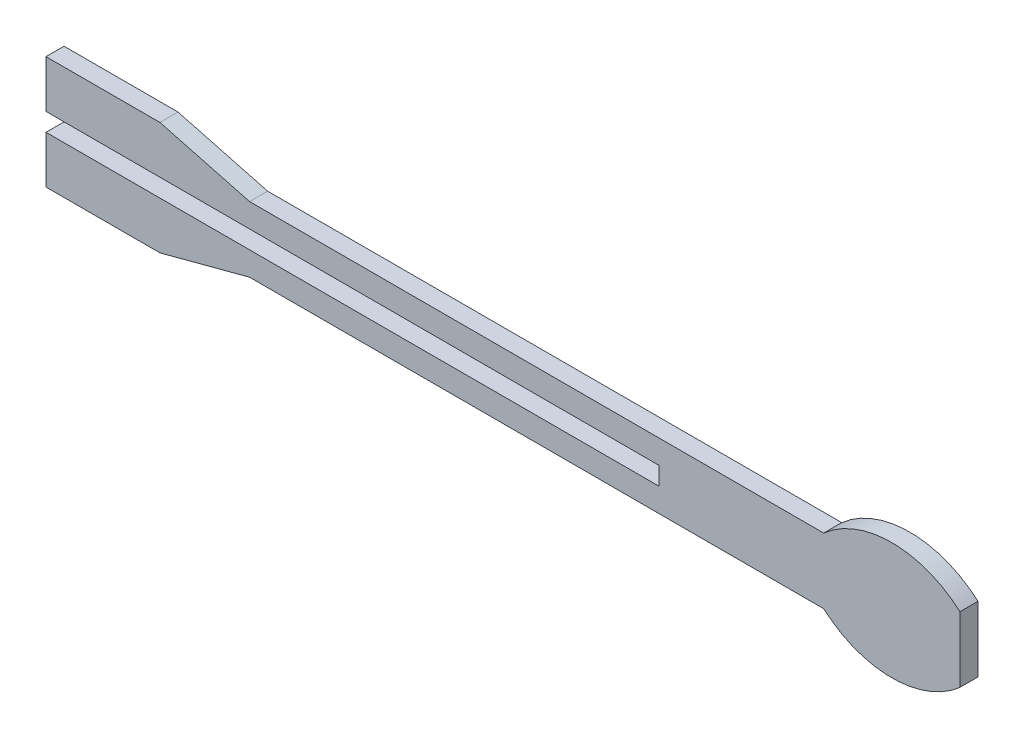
from build123d import *

# Parameters (mm, degrees)
BOSS_EXTRUDE1_DEPTH = 1.524


with BuildPart() as part:
    # Sketch1 → Boss-Extrude1 (new body)
    with BuildSketch(Plane.XY):
        with BuildLine():
            Line((50.135313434, -1.524), (-1.638352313, -1.524))
            Line((-1.638352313, -1.524), (-1.638352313, -5.53152575))
            Line((-1.638352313, -5.53152575), (7.98004005, -5.53152575))
            Line((7.98004005, -5.53152575), (15.553391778, -3.527762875))
            Line((15.553391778, -3.527762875), (64.02780629, -3.527762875))
            ThreePointArc((64.02780629, -3.527762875), (69.781559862, -5.710451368), (75.535313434, -3.527762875))
            Line((75.535313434, -3.527762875), (75.535313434, 2.003762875))
            ThreePointArc((75.535313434, 2.003762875), (69.781559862, 4.186451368), (64.02780629, 2.003762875))
            Line((64.02780629, 2.003762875), (15.553391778, 2.003762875))
            Line((15.553391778, 2.003762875), (7.98004005, 4.00752575))
            Line((7.98004005, 4.00752575), (-1.638352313, 4.00752575))
            Line((-1.638352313, 4.00752575), (-1.638352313, 0))
            Line((-1.638352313, 0), (50.135313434, 0))
            Line((50.135313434, 0), (50.135313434, -1.524))
        make_face()
    extrude(amount=BOSS_EXTRUDE1_DEPTH)


solid = part.part
